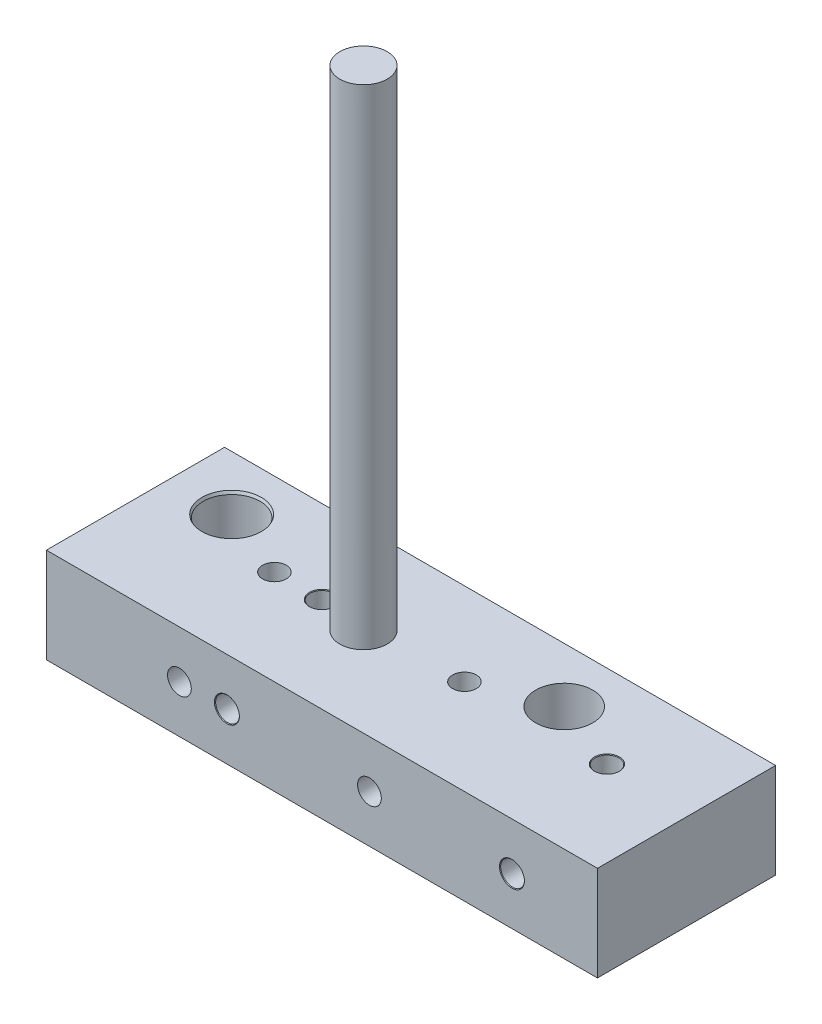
ISO-10303-21;
HEADER;
FILE_DESCRIPTION(('STEP AP214'),'2;1');
FILE_NAME('part.step','',(''),(''),'','','');
FILE_SCHEMA(('AUTOMOTIVE_DESIGN { 1 0 10303 214 1 1 1 1 }'));
ENDSEC;
DATA;
#1=APPLICATION_CONTEXT('core data for automotive mechanical design processes');
#2=APPLICATION_PROTOCOL_DEFINITION('international standard','automotive_design',2000,#1);
#3=PRODUCT_CONTEXT('',#1,'mechanical');
#4=PRODUCT('Part','Part','',(#3));
#5=PRODUCT_RELATED_PRODUCT_CATEGORY('part','',(#4));
#6=PRODUCT_DEFINITION_FORMATION('','',#4);
#7=PRODUCT_DEFINITION_CONTEXT('part definition',#1,'design');
#8=PRODUCT_DEFINITION('design','',#6,#7);
#9=PRODUCT_DEFINITION_SHAPE('','',#8);
#10=(LENGTH_UNIT() NAMED_UNIT(*) SI_UNIT(.MILLI.,.METRE.));
#11=(NAMED_UNIT(*) PLANE_ANGLE_UNIT() SI_UNIT($,.RADIAN.));
#12=(NAMED_UNIT(*) SI_UNIT($,.STERADIAN.) SOLID_ANGLE_UNIT());
#13=UNCERTAINTY_MEASURE_WITH_UNIT(LENGTH_MEASURE(1.E-05),#10,'distance_accuracy_value','');
#14=(GEOMETRIC_REPRESENTATION_CONTEXT(3) GLOBAL_UNCERTAINTY_ASSIGNED_CONTEXT((#13)) GLOBAL_UNIT_ASSIGNED_CONTEXT((#10,
#11,#12)) REPRESENTATION_CONTEXT('',''));
#15=CARTESIAN_POINT('',(0.,0.,0.));
#16=DIRECTION('',(0.,0.,1.));
#17=DIRECTION('',(1.,0.,0.));
#18=AXIS2_PLACEMENT_3D('',#15,#16,#17);
#19=CARTESIAN_POINT('',(0.,20.,-37.5));
#20=DIRECTION('',(0.,-1.,0.));
#21=DIRECTION('',(0.,0.,-1.));
#22=AXIS2_PLACEMENT_3D('',#19,#20,#21);
#23=PLANE('',#22);
#24=CARTESIAN_POINT('',(83.,20.,-26.));
#25=DIRECTION('',(0.,-1.,0.));
#26=DIRECTION('',(0.,0.,-1.));
#27=AXIS2_PLACEMENT_3D('',#24,#25,#26);
#28=CIRCLE('',#27,5.99999999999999);
#29=CARTESIAN_POINT('',(83.,20.,-32.));
#30=VERTEX_POINT('',#29);
#31=EDGE_CURVE('E9178',#30,#30,#28,.T.);
#32=ORIENTED_EDGE('',*,*,#31,.T.);
#33=EDGE_LOOP('',(#32));
#34=FACE_BOUND('',#33,.T.);
#35=DIRECTION('',(0.,0.,1.));
#36=VECTOR('',#35,1.);
#37=CARTESIAN_POINT('',(0.,20.,0.));
#38=LINE('',#37,#36);
#39=CARTESIAN_POINT('',(0.,20.,-37.5));
#40=VERTEX_POINT('',#39);
#41=CARTESIAN_POINT('',(0.,20.,0.));
#42=VERTEX_POINT('',#41);
#43=EDGE_CURVE('E9306',#40,#42,#38,.T.);
#44=ORIENTED_EDGE('',*,*,#43,.T.);
#45=DIRECTION('',(1.,0.,0.));
#46=VECTOR('',#45,1.);
#47=CARTESIAN_POINT('',(0.,20.,0.));
#48=LINE('',#47,#46);
#49=CARTESIAN_POINT('',(116.,20.,0.));
#50=VERTEX_POINT('',#49);
#51=EDGE_CURVE('E9304',#42,#50,#48,.T.);
#52=ORIENTED_EDGE('',*,*,#51,.T.);
#53=DIRECTION('',(0.,0.,-1.));
#54=VECTOR('',#53,1.);
#55=CARTESIAN_POINT('',(116.,20.,0.));
#56=LINE('',#55,#54);
#57=CARTESIAN_POINT('',(116.,20.,-37.5));
#58=VERTEX_POINT('',#57);
#59=EDGE_CURVE('E9302',#50,#58,#56,.T.);
#60=ORIENTED_EDGE('',*,*,#59,.T.);
#61=DIRECTION('',(-1.,0.,0.));
#62=VECTOR('',#61,1.);
#63=CARTESIAN_POINT('',(0.,20.,-37.5));
#64=LINE('',#63,#62);
#65=EDGE_CURVE('E9300',#58,#40,#64,.T.);
#66=ORIENTED_EDGE('',*,*,#65,.T.);
#67=EDGE_LOOP('',(#44,#52,#60,#66));
#68=FACE_BOUND('',#67,.T.);
#69=CARTESIAN_POINT('',(13.,20.,-26.));
#70=DIRECTION('',(0.,-1.,0.));
#71=DIRECTION('',(0.,0.,-1.));
#72=AXIS2_PLACEMENT_3D('',#69,#70,#71);
#73=CIRCLE('',#72,6.25);
#74=CARTESIAN_POINT('',(13.,20.,-32.25));
#75=VERTEX_POINT('',#74);
#76=EDGE_CURVE('E9327',#75,#75,#73,.T.);
#77=ORIENTED_EDGE('',*,*,#76,.T.);
#78=EDGE_LOOP('',(#77));
#79=FACE_BOUND('',#78,.T.);
#80=CARTESIAN_POINT('',(28.,20.,-20.));
#81=DIRECTION('',(0.,-1.,0.));
#82=DIRECTION('',(0.,0.,-1.));
#83=AXIS2_PLACEMENT_3D('',#80,#81,#82);
#84=CIRCLE('',#83,2.5);
#85=CARTESIAN_POINT('',(28.,20.,-22.5));
#86=VERTEX_POINT('',#85);
#87=EDGE_CURVE('E9333',#86,#86,#84,.T.);
#88=ORIENTED_EDGE('',*,*,#87,.T.);
#89=EDGE_LOOP('',(#88));
#90=FACE_BOUND('',#89,.T.);
#91=CARTESIAN_POINT('',(68.,20.,-20.));
#92=DIRECTION('',(0.,-1.,0.));
#93=DIRECTION('',(0.,0.,-1.));
#94=AXIS2_PLACEMENT_3D('',#91,#92,#93);
#95=CIRCLE('',#94,2.5);
#96=CARTESIAN_POINT('',(68.,20.,-22.5));
#97=VERTEX_POINT('',#96);
#98=EDGE_CURVE('E9339',#97,#97,#95,.T.);
#99=ORIENTED_EDGE('',*,*,#98,.T.);
#100=EDGE_LOOP('',(#99));
#101=FACE_BOUND('',#100,.T.);
#102=CARTESIAN_POINT('',(38.,20.,-20.));
#103=DIRECTION('',(0.,-1.,0.));
#104=DIRECTION('',(0.,0.,-1.));
#105=AXIS2_PLACEMENT_3D('',#102,#103,#104);
#106=CIRCLE('',#105,2.625);
#107=CARTESIAN_POINT('',(38.,20.,-22.625));
#108=VERTEX_POINT('',#107);
#109=EDGE_CURVE('E9351',#108,#108,#106,.T.);
#110=ORIENTED_EDGE('',*,*,#109,.T.);
#111=EDGE_LOOP('',(#110));
#112=FACE_BOUND('',#111,.T.);
#113=CARTESIAN_POINT('',(98.,20.,-20.));
#114=DIRECTION('',(0.,-1.,0.));
#115=DIRECTION('',(0.,0.,-1.));
#116=AXIS2_PLACEMENT_3D('',#113,#114,#115);
#117=CIRCLE('',#116,2.62499999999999);
#118=CARTESIAN_POINT('',(98.,20.,-22.625));
#119=VERTEX_POINT('',#118);
#120=EDGE_CURVE('E9363',#119,#119,#117,.T.);
#121=ORIENTED_EDGE('',*,*,#120,.T.);
#122=EDGE_LOOP('',(#121));
#123=FACE_BOUND('',#122,.T.);
#124=CARTESIAN_POINT('',(48.,20.,-18.75));
#125=DIRECTION('',(0.,-1.,0.));
#126=DIRECTION('',(0.,0.,-1.));
#127=AXIS2_PLACEMENT_3D('',#124,#125,#126);
#128=CIRCLE('',#127,5.);
#129=CARTESIAN_POINT('',(48.,20.,-23.75));
#130=VERTEX_POINT('',#129);
#131=EDGE_CURVE('E11',#130,#130,#128,.F.);
#132=ORIENTED_EDGE('',*,*,#131,.F.);
#133=EDGE_LOOP('',(#132));
#134=FACE_BOUND('',#133,.T.);
#135=ADVANCED_FACE('F9174',(#34,#68,#79,#90,#101,#112,#123,#134),#23,.F.);
#136=CARTESIAN_POINT('',(68.,0.,-20.));
#137=DIRECTION('',(0.,-1.,0.));
#138=DIRECTION('',(0.,0.,-1.));
#139=AXIS2_PLACEMENT_3D('',#136,#137,#138);
#140=CYLINDRICAL_SURFACE('',#139,2.5);
#141=CARTESIAN_POINT('',(68.,0.,-20.));
#142=DIRECTION('',(0.,-1.,0.));
#143=DIRECTION('',(0.,0.,-1.));
#144=AXIS2_PLACEMENT_3D('',#141,#142,#143);
#145=CIRCLE('',#144,2.49999999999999);
#146=CARTESIAN_POINT('',(68.,0.,-22.5));
#147=VERTEX_POINT('',#146);
#148=EDGE_CURVE('E9336',#147,#147,#145,.T.);
#149=ORIENTED_EDGE('',*,*,#148,.T.);
#150=EDGE_LOOP('',(#149));
#151=FACE_BOUND('',#150,.T.);
#152=CARTESIAN_POINT('',(68.,10.,-20.));
#153=DIRECTION('',(0.,-0.707106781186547,-0.707106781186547));
#154=DIRECTION('',(0.,-0.707106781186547,0.707106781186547));
#155=AXIS2_PLACEMENT_3D('',#152,#153,#154);
#156=ELLIPSE('',#155,3.53553390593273,2.49999999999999);
#157=CARTESIAN_POINT('',(65.5,10.,-20.));
#158=VERTEX_POINT('',#157);
#159=CARTESIAN_POINT('',(70.5,10.,-20.));
#160=VERTEX_POINT('',#159);
#161=EDGE_CURVE('E9189',#158,#160,#156,.F.);
#162=ORIENTED_EDGE('',*,*,#161,.T.);
#163=CARTESIAN_POINT('',(68.,10.,-20.));
#164=DIRECTION('',(0.,-0.707106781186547,0.707106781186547));
#165=DIRECTION('',(0.,-0.707106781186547,-0.707106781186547));
#166=AXIS2_PLACEMENT_3D('',#163,#164,#165);
#167=ELLIPSE('',#166,3.53553390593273,2.49999999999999);
#168=EDGE_CURVE('E9183',#160,#158,#167,.F.);
#169=ORIENTED_EDGE('',*,*,#168,.T.);
#170=EDGE_LOOP('',(#162,#169));
#171=FACE_BOUND('',#170,.T.);
#172=ADVANCED_FACE('F9252',(#151,#171),#140,.F.);
#173=CARTESIAN_POINT('',(28.,0.,-20.));
#174=DIRECTION('',(0.,-1.,0.));
#175=DIRECTION('',(0.,0.,-1.));
#176=AXIS2_PLACEMENT_3D('',#173,#174,#175);
#177=CYLINDRICAL_SURFACE('',#176,2.49999999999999);
#178=CARTESIAN_POINT('',(28.,0.,-20.));
#179=DIRECTION('',(0.,-1.,0.));
#180=DIRECTION('',(0.,0.,-1.));
#181=AXIS2_PLACEMENT_3D('',#178,#179,#180);
#182=CIRCLE('',#181,2.49999999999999);
#183=CARTESIAN_POINT('',(28.,0.,-22.5));
#184=VERTEX_POINT('',#183);
#185=EDGE_CURVE('E9330',#184,#184,#182,.T.);
#186=ORIENTED_EDGE('',*,*,#185,.T.);
#187=EDGE_LOOP('',(#186));
#188=FACE_BOUND('',#187,.T.);
#189=CARTESIAN_POINT('',(28.,10.,-20.));
#190=DIRECTION('',(0.,-0.707106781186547,-0.707106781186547));
#191=DIRECTION('',(0.,-0.707106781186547,0.707106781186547));
#192=AXIS2_PLACEMENT_3D('',#189,#190,#191);
#193=ELLIPSE('',#192,3.53553390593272,2.49999999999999);
#194=CARTESIAN_POINT('',(25.5,10.,-20.));
#195=VERTEX_POINT('',#194);
#196=CARTESIAN_POINT('',(30.5,10.,-20.));
#197=VERTEX_POINT('',#196);
#198=EDGE_CURVE('E9196',#195,#197,#193,.F.);
#199=ORIENTED_EDGE('',*,*,#198,.T.);
#200=CARTESIAN_POINT('',(28.,10.,-20.));
#201=DIRECTION('',(0.,-0.707106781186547,0.707106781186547));
#202=DIRECTION('',(0.,-0.707106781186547,-0.707106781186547));
#203=AXIS2_PLACEMENT_3D('',#200,#201,#202);
#204=ELLIPSE('',#203,3.53553390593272,2.49999999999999);
#205=EDGE_CURVE('E9250',#197,#195,#204,.F.);
#206=ORIENTED_EDGE('',*,*,#205,.T.);
#207=EDGE_LOOP('',(#199,#206));
#208=FACE_BOUND('',#207,.T.);
#209=ADVANCED_FACE('F9549',(#188,#208),#177,.F.);
#210=CARTESIAN_POINT('',(98.,0.,-20.));
#211=DIRECTION('',(0.,-1.,0.));
#212=DIRECTION('',(0.,0.,-1.));
#213=AXIS2_PLACEMENT_3D('',#210,#211,#212);
#214=CYLINDRICAL_SURFACE('',#213,2.5);
#215=CARTESIAN_POINT('',(98.,0.125000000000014,-20.));
#216=DIRECTION('',(0.,-1.,0.));
#217=DIRECTION('',(0.,0.,-1.));
#218=AXIS2_PLACEMENT_3D('',#215,#216,#217);
#219=CIRCLE('',#218,2.49999999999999);
#220=CARTESIAN_POINT('',(98.,0.125000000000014,-22.5));
#221=VERTEX_POINT('',#220);
#222=EDGE_CURVE('E9357',#221,#221,#219,.T.);
#223=ORIENTED_EDGE('',*,*,#222,.T.);
#224=EDGE_LOOP('',(#223));
#225=FACE_BOUND('',#224,.T.);
#226=CARTESIAN_POINT('',(98.,10.,-20.));
#227=DIRECTION('',(0.,-0.707106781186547,-0.707106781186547));
#228=DIRECTION('',(0.,-0.707106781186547,0.707106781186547));
#229=AXIS2_PLACEMENT_3D('',#226,#227,#228);
#230=ELLIPSE('',#229,3.53553390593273,2.5);
#231=CARTESIAN_POINT('',(95.5,10.,-20.));
#232=VERTEX_POINT('',#231);
#233=CARTESIAN_POINT('',(100.5,10.,-20.));
#234=VERTEX_POINT('',#233);
#235=EDGE_CURVE('E9275',#232,#234,#230,.F.);
#236=ORIENTED_EDGE('',*,*,#235,.T.);
#237=CARTESIAN_POINT('',(98.,10.,-20.));
#238=DIRECTION('',(0.,-0.707106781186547,0.707106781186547));
#239=DIRECTION('',(0.,-0.707106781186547,-0.707106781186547));
#240=AXIS2_PLACEMENT_3D('',#237,#238,#239);
#241=ELLIPSE('',#240,3.53553390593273,2.5);
#242=EDGE_CURVE('E9266',#234,#232,#241,.F.);
#243=ORIENTED_EDGE('',*,*,#242,.T.);
#244=EDGE_LOOP('',(#236,#243));
#245=FACE_BOUND('',#244,.T.);
#246=ADVANCED_FACE('F9525',(#225,#245),#214,.F.);
#247=CARTESIAN_POINT('',(38.,0.,-20.));
#248=DIRECTION('',(0.,-1.,0.));
#249=DIRECTION('',(0.,0.,-1.));
#250=AXIS2_PLACEMENT_3D('',#247,#248,#249);
#251=CYLINDRICAL_SURFACE('',#250,2.5);
#252=CARTESIAN_POINT('',(38.,0.125,-20.));
#253=DIRECTION('',(0.,-1.,0.));
#254=DIRECTION('',(0.,0.,-1.));
#255=AXIS2_PLACEMENT_3D('',#252,#253,#254);
#256=CIRCLE('',#255,2.5);
#257=CARTESIAN_POINT('',(38.,0.125,-22.5));
#258=VERTEX_POINT('',#257);
#259=EDGE_CURVE('E9345',#258,#258,#256,.T.);
#260=ORIENTED_EDGE('',*,*,#259,.T.);
#261=EDGE_LOOP('',(#260));
#262=FACE_BOUND('',#261,.T.);
#263=CARTESIAN_POINT('',(38.,10.,-20.));
#264=DIRECTION('',(0.,-0.707106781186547,-0.707106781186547));
#265=DIRECTION('',(0.,-0.707106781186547,0.707106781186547));
#266=AXIS2_PLACEMENT_3D('',#263,#264,#265);
#267=ELLIPSE('',#266,3.53553390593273,2.49999999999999);
#268=CARTESIAN_POINT('',(35.5,10.,-20.));
#269=VERTEX_POINT('',#268);
#270=CARTESIAN_POINT('',(40.5,10.,-20.));
#271=VERTEX_POINT('',#270);
#272=EDGE_CURVE('E9286',#269,#271,#267,.F.);
#273=ORIENTED_EDGE('',*,*,#272,.T.);
#274=CARTESIAN_POINT('',(38.,10.,-20.));
#275=DIRECTION('',(0.,-0.707106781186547,0.707106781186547));
#276=DIRECTION('',(0.,-0.707106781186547,-0.707106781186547));
#277=AXIS2_PLACEMENT_3D('',#274,#275,#276);
#278=ELLIPSE('',#277,3.53553390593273,2.49999999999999);
#279=EDGE_CURVE('E9277',#271,#269,#278,.F.);
#280=ORIENTED_EDGE('',*,*,#279,.T.);
#281=EDGE_LOOP('',(#273,#280));
#282=FACE_BOUND('',#281,.T.);
#283=ADVANCED_FACE('F9538',(#262,#282),#251,.F.);
#284=CARTESIAN_POINT('',(0.,20.,0.));
#285=DIRECTION('',(1.,0.,0.));
#286=DIRECTION('',(0.,0.,-1.));
#287=AXIS2_PLACEMENT_3D('',#284,#285,#286);
#288=PLANE('',#287);
#289=DIRECTION('',(0.,0.,1.));
#290=VECTOR('',#289,1.);
#291=CARTESIAN_POINT('',(0.,0.,0.));
#292=LINE('',#291,#290);
#293=CARTESIAN_POINT('',(0.,0.,-37.5));
#294=VERTEX_POINT('',#293);
#295=CARTESIAN_POINT('',(0.,0.,0.));
#296=VERTEX_POINT('',#295);
#297=EDGE_CURVE('E9315',#294,#296,#292,.T.);
#298=ORIENTED_EDGE('',*,*,#297,.T.);
#299=DIRECTION('',(0.,-1.,0.));
#300=VECTOR('',#299,1.);
#301=CARTESIAN_POINT('',(0.,20.,0.));
#302=LINE('',#301,#300);
#303=EDGE_CURVE('E9288',#42,#296,#302,.T.);
#304=ORIENTED_EDGE('',*,*,#303,.F.);
#305=ORIENTED_EDGE('',*,*,#43,.F.);
#306=DIRECTION('',(0.,-1.,0.));
#307=VECTOR('',#306,1.);
#308=CARTESIAN_POINT('',(0.,20.,-37.5));
#309=LINE('',#308,#307);
#310=EDGE_CURVE('E9297',#40,#294,#309,.T.);
#311=ORIENTED_EDGE('',*,*,#310,.T.);
#312=EDGE_LOOP('',(#298,#304,#305,#311));
#313=FACE_BOUND('',#312,.T.);
#314=ADVANCED_FACE('F9176',(#313),#288,.F.);
#315=CARTESIAN_POINT('',(0.,20.,0.));
#316=DIRECTION('',(0.,0.,-1.));
#317=DIRECTION('',(-1.,0.,0.));
#318=AXIS2_PLACEMENT_3D('',#315,#316,#317);
#319=PLANE('',#318);
#320=CARTESIAN_POINT('',(68.,10.,0.));
#321=DIRECTION('',(0.,0.,1.));
#322=DIRECTION('',(1.,0.,0.));
#323=AXIS2_PLACEMENT_3D('',#320,#321,#322);
#324=CIRCLE('',#323,2.49999999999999);
#325=CARTESIAN_POINT('',(70.5,10.,0.));
#326=VERTEX_POINT('',#325);
#327=EDGE_CURVE('E9396',#326,#326,#324,.T.);
#328=ORIENTED_EDGE('',*,*,#327,.F.);
#329=EDGE_LOOP('',(#328));
#330=FACE_BOUND('',#329,.T.);
#331=CARTESIAN_POINT('',(28.,10.,0.));
#332=DIRECTION('',(0.,0.,1.));
#333=DIRECTION('',(1.,0.,0.));
#334=AXIS2_PLACEMENT_3D('',#331,#332,#333);
#335=CIRCLE('',#334,2.49999999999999);
#336=CARTESIAN_POINT('',(30.5,10.,0.));
#337=VERTEX_POINT('',#336);
#338=EDGE_CURVE('E9390',#337,#337,#335,.T.);
#339=ORIENTED_EDGE('',*,*,#338,.F.);
#340=EDGE_LOOP('',(#339));
#341=FACE_BOUND('',#340,.T.);
#342=CARTESIAN_POINT('',(98.,10.,0.));
#343=DIRECTION('',(0.,0.,1.));
#344=DIRECTION('',(1.,0.,0.));
#345=AXIS2_PLACEMENT_3D('',#342,#343,#344);
#346=CIRCLE('',#345,2.625);
#347=CARTESIAN_POINT('',(100.625,10.,0.));
#348=VERTEX_POINT('',#347);
#349=EDGE_CURVE('E9378',#348,#348,#346,.T.);
#350=ORIENTED_EDGE('',*,*,#349,.F.);
#351=EDGE_LOOP('',(#350));
#352=FACE_BOUND('',#351,.T.);
#353=CARTESIAN_POINT('',(38.,10.,0.));
#354=DIRECTION('',(0.,0.,1.));
#355=DIRECTION('',(1.,0.,0.));
#356=AXIS2_PLACEMENT_3D('',#353,#354,#355);
#357=CIRCLE('',#356,2.625);
#358=CARTESIAN_POINT('',(40.625,10.,0.));
#359=VERTEX_POINT('',#358);
#360=EDGE_CURVE('E9366',#359,#359,#357,.T.);
#361=ORIENTED_EDGE('',*,*,#360,.F.);
#362=EDGE_LOOP('',(#361));
#363=FACE_BOUND('',#362,.T.);
#364=DIRECTION('',(1.,0.,0.));
#365=VECTOR('',#364,1.);
#366=CARTESIAN_POINT('',(0.,0.,0.));
#367=LINE('',#366,#365);
#368=CARTESIAN_POINT('',(116.,0.,0.));
#369=VERTEX_POINT('',#368);
#370=EDGE_CURVE('E9313',#296,#369,#367,.T.);
#371=ORIENTED_EDGE('',*,*,#370,.T.);
#372=DIRECTION('',(0.,-1.,0.));
#373=VECTOR('',#372,1.);
#374=CARTESIAN_POINT('',(116.,20.,0.));
#375=LINE('',#374,#373);
#376=EDGE_CURVE('E9291',#50,#369,#375,.T.);
#377=ORIENTED_EDGE('',*,*,#376,.F.);
#378=ORIENTED_EDGE('',*,*,#51,.F.);
#379=ORIENTED_EDGE('',*,*,#303,.T.);
#380=EDGE_LOOP('',(#371,#377,#378,#379));
#381=FACE_BOUND('',#380,.T.);
#382=ADVANCED_FACE('F9452',(#330,#341,#352,#363,#381),#319,.F.);
#383=CARTESIAN_POINT('',(116.,20.,0.));
#384=DIRECTION('',(-1.,0.,0.));
#385=DIRECTION('',(0.,0.,1.));
#386=AXIS2_PLACEMENT_3D('',#383,#384,#385);
#387=PLANE('',#386);
#388=DIRECTION('',(0.,0.,-1.));
#389=VECTOR('',#388,1.);
#390=CARTESIAN_POINT('',(116.,0.,0.));
#391=LINE('',#390,#389);
#392=CARTESIAN_POINT('',(116.,0.,-37.5));
#393=VERTEX_POINT('',#392);
#394=EDGE_CURVE('E9311',#369,#393,#391,.T.);
#395=ORIENTED_EDGE('',*,*,#394,.T.);
#396=DIRECTION('',(0.,-1.,0.));
#397=VECTOR('',#396,1.);
#398=CARTESIAN_POINT('',(116.,20.,-37.5));
#399=LINE('',#398,#397);
#400=EDGE_CURVE('E9294',#58,#393,#399,.T.);
#401=ORIENTED_EDGE('',*,*,#400,.F.);
#402=ORIENTED_EDGE('',*,*,#59,.F.);
#403=ORIENTED_EDGE('',*,*,#376,.T.);
#404=EDGE_LOOP('',(#395,#401,#402,#403));
#405=FACE_BOUND('',#404,.T.);
#406=ADVANCED_FACE('F9449',(#405),#387,.F.);
#407=CARTESIAN_POINT('',(0.,20.,-37.5));
#408=DIRECTION('',(0.,0.,1.));
#409=DIRECTION('',(1.,0.,0.));
#410=AXIS2_PLACEMENT_3D('',#407,#408,#409);
#411=PLANE('',#410);
#412=CARTESIAN_POINT('',(68.,10.,-37.5));
#413=DIRECTION('',(0.,0.,1.));
#414=DIRECTION('',(1.,0.,0.));
#415=AXIS2_PLACEMENT_3D('',#412,#413,#414);
#416=CIRCLE('',#415,2.49999999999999);
#417=CARTESIAN_POINT('',(70.5,10.,-37.5));
#418=VERTEX_POINT('',#417);
#419=EDGE_CURVE('E9399',#418,#418,#416,.T.);
#420=ORIENTED_EDGE('',*,*,#419,.T.);
#421=EDGE_LOOP('',(#420));
#422=FACE_BOUND('',#421,.T.);
#423=CARTESIAN_POINT('',(28.,10.,-37.5));
#424=DIRECTION('',(0.,0.,1.));
#425=DIRECTION('',(1.,0.,0.));
#426=AXIS2_PLACEMENT_3D('',#423,#424,#425);
#427=CIRCLE('',#426,2.49999999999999);
#428=CARTESIAN_POINT('',(30.5,10.,-37.5));
#429=VERTEX_POINT('',#428);
#430=EDGE_CURVE('E9393',#429,#429,#427,.T.);
#431=ORIENTED_EDGE('',*,*,#430,.T.);
#432=EDGE_LOOP('',(#431));
#433=FACE_BOUND('',#432,.T.);
#434=CARTESIAN_POINT('',(98.,10.,-37.5));
#435=DIRECTION('',(0.,0.,1.));
#436=DIRECTION('',(1.,0.,0.));
#437=AXIS2_PLACEMENT_3D('',#434,#435,#436);
#438=CIRCLE('',#437,2.62499999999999);
#439=CARTESIAN_POINT('',(100.625,10.,-37.5));
#440=VERTEX_POINT('',#439);
#441=EDGE_CURVE('E9387',#440,#440,#438,.T.);
#442=ORIENTED_EDGE('',*,*,#441,.T.);
#443=EDGE_LOOP('',(#442));
#444=FACE_BOUND('',#443,.T.);
#445=CARTESIAN_POINT('',(38.,10.,-37.5));
#446=DIRECTION('',(0.,0.,1.));
#447=DIRECTION('',(1.,0.,0.));
#448=AXIS2_PLACEMENT_3D('',#445,#446,#447);
#449=CIRCLE('',#448,2.62499999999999);
#450=CARTESIAN_POINT('',(40.625,10.,-37.5));
#451=VERTEX_POINT('',#450);
#452=EDGE_CURVE('E9375',#451,#451,#449,.T.);
#453=ORIENTED_EDGE('',*,*,#452,.T.);
#454=EDGE_LOOP('',(#453));
#455=FACE_BOUND('',#454,.T.);
#456=DIRECTION('',(-1.,0.,0.));
#457=VECTOR('',#456,1.);
#458=CARTESIAN_POINT('',(0.,0.,-37.5));
#459=LINE('',#458,#457);
#460=EDGE_CURVE('E9309',#393,#294,#459,.T.);
#461=ORIENTED_EDGE('',*,*,#460,.T.);
#462=ORIENTED_EDGE('',*,*,#310,.F.);
#463=ORIENTED_EDGE('',*,*,#65,.F.);
#464=ORIENTED_EDGE('',*,*,#400,.T.);
#465=EDGE_LOOP('',(#461,#462,#463,#464));
#466=FACE_BOUND('',#465,.T.);
#467=ADVANCED_FACE('F9425',(#422,#433,#444,#455,#466),#411,.F.);
#468=CARTESIAN_POINT('',(0.,0.,-37.5));
#469=DIRECTION('',(0.,-1.,0.));
#470=DIRECTION('',(0.,0.,-1.));
#471=AXIS2_PLACEMENT_3D('',#468,#469,#470);
#472=PLANE('',#471);
#473=CARTESIAN_POINT('',(83.,0.,-26.));
#474=DIRECTION('',(0.,-1.,0.));
#475=DIRECTION('',(0.,0.,-1.));
#476=AXIS2_PLACEMENT_3D('',#473,#474,#475);
#477=CIRCLE('',#476,6.25000000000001);
#478=CARTESIAN_POINT('',(83.,0.,-32.25));
#479=VERTEX_POINT('',#478);
#480=EDGE_CURVE('E9405',#479,#479,#477,.T.);
#481=ORIENTED_EDGE('',*,*,#480,.F.);
#482=EDGE_LOOP('',(#481));
#483=FACE_BOUND('',#482,.T.);
#484=CARTESIAN_POINT('',(98.,0.,-20.));
#485=DIRECTION('',(0.,-1.,0.));
#486=DIRECTION('',(0.,0.,-1.));
#487=AXIS2_PLACEMENT_3D('',#484,#485,#486);
#488=CIRCLE('',#487,2.625);
#489=CARTESIAN_POINT('',(98.,0.,-22.625));
#490=VERTEX_POINT('',#489);
#491=EDGE_CURVE('E9354',#490,#490,#488,.T.);
#492=ORIENTED_EDGE('',*,*,#491,.F.);
#493=EDGE_LOOP('',(#492));
#494=FACE_BOUND('',#493,.T.);
#495=CARTESIAN_POINT('',(38.,0.,-20.));
#496=DIRECTION('',(0.,-1.,0.));
#497=DIRECTION('',(0.,0.,-1.));
#498=AXIS2_PLACEMENT_3D('',#495,#496,#497);
#499=CIRCLE('',#498,2.625);
#500=CARTESIAN_POINT('',(38.,0.,-22.625));
#501=VERTEX_POINT('',#500);
#502=EDGE_CURVE('E9342',#501,#501,#499,.T.);
#503=ORIENTED_EDGE('',*,*,#502,.F.);
#504=EDGE_LOOP('',(#503));
#505=FACE_BOUND('',#504,.T.);
#506=ORIENTED_EDGE('',*,*,#148,.F.);
#507=EDGE_LOOP('',(#506));
#508=FACE_BOUND('',#507,.T.);
#509=ORIENTED_EDGE('',*,*,#185,.F.);
#510=EDGE_LOOP('',(#509));
#511=FACE_BOUND('',#510,.T.);
#512=CARTESIAN_POINT('',(13.,0.,-26.));
#513=DIRECTION('',(0.,-1.,0.));
#514=DIRECTION('',(0.,0.,-1.));
#515=AXIS2_PLACEMENT_3D('',#512,#513,#514);
#516=CIRCLE('',#515,6.25);
#517=CARTESIAN_POINT('',(13.,0.,-32.25));
#518=VERTEX_POINT('',#517);
#519=EDGE_CURVE('E9318',#518,#518,#516,.T.);
#520=ORIENTED_EDGE('',*,*,#519,.F.);
#521=EDGE_LOOP('',(#520));
#522=FACE_BOUND('',#521,.T.);
#523=ORIENTED_EDGE('',*,*,#297,.F.);
#524=ORIENTED_EDGE('',*,*,#460,.F.);
#525=ORIENTED_EDGE('',*,*,#394,.F.);
#526=ORIENTED_EDGE('',*,*,#370,.F.);
#527=EDGE_LOOP('',(#523,#524,#525,#526));
#528=FACE_BOUND('',#527,.T.);
#529=ADVANCED_FACE('F9421',(#483,#494,#505,#508,#511,#522,#528),#472,.T.);
#530=CARTESIAN_POINT('',(13.,0.,-26.));
#531=DIRECTION('',(0.,-1.,0.));
#532=DIRECTION('',(0.,0.,-1.));
#533=AXIS2_PLACEMENT_3D('',#530,#531,#532);
#534=CONICAL_SURFACE('',#533,6.25,0.392699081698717);
#535=CARTESIAN_POINT('',(13.,0.603553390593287,-26.));
#536=DIRECTION('',(0.,-1.,0.));
#537=DIRECTION('',(0.,0.,-1.));
#538=AXIS2_PLACEMENT_3D('',#535,#536,#537);
#539=CIRCLE('',#538,6.);
#540=CARTESIAN_POINT('',(13.,0.603553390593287,-32.));
#541=VERTEX_POINT('',#540);
#542=EDGE_CURVE('E9321',#541,#541,#539,.T.);
#543=ORIENTED_EDGE('',*,*,#542,.F.);
#544=EDGE_LOOP('',(#543));
#545=FACE_BOUND('',#544,.T.);
#546=ORIENTED_EDGE('',*,*,#519,.T.);
#547=EDGE_LOOP('',(#546));
#548=FACE_BOUND('',#547,.T.);
#549=ADVANCED_FACE('F9424',(#545,#548),#534,.F.);
#550=CARTESIAN_POINT('',(13.,0.,-26.));
#551=DIRECTION('',(0.,-1.,0.));
#552=DIRECTION('',(0.,0.,-1.));
#553=AXIS2_PLACEMENT_3D('',#550,#551,#552);
#554=CYLINDRICAL_SURFACE('',#553,6.);
#555=CARTESIAN_POINT('',(13.,19.3964466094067,-26.));
#556=DIRECTION('',(0.,-1.,0.));
#557=DIRECTION('',(0.,0.,-1.));
#558=AXIS2_PLACEMENT_3D('',#555,#556,#557);
#559=CIRCLE('',#558,5.99999999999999);
#560=CARTESIAN_POINT('',(13.,19.3964466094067,-32.));
#561=VERTEX_POINT('',#560);
#562=EDGE_CURVE('E9324',#561,#561,#559,.T.);
#563=ORIENTED_EDGE('',*,*,#562,.F.);
#564=EDGE_LOOP('',(#563));
#565=FACE_BOUND('',#564,.T.);
#566=ORIENTED_EDGE('',*,*,#542,.T.);
#567=EDGE_LOOP('',(#566));
#568=FACE_BOUND('',#567,.T.);
#569=ADVANCED_FACE('F9552',(#565,#568),#554,.F.);
#570=CARTESIAN_POINT('',(13.,19.3964466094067,-26.));
#571=DIRECTION('',(0.,1.,0.));
#572=DIRECTION('',(0.,0.,1.));
#573=AXIS2_PLACEMENT_3D('',#570,#571,#572);
#574=CONICAL_SURFACE('',#573,5.99999999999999,0.392699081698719);
#575=ORIENTED_EDGE('',*,*,#76,.F.);
#576=EDGE_LOOP('',(#575));
#577=FACE_BOUND('',#576,.T.);
#578=ORIENTED_EDGE('',*,*,#562,.T.);
#579=EDGE_LOOP('',(#578));
#580=FACE_BOUND('',#579,.T.);
#581=ADVANCED_FACE('F9547',(#577,#580),#574,.F.);
#582=CARTESIAN_POINT('',(28.,10.,-20.));
#583=DIRECTION('',(0.,-0.707106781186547,-0.707106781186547));
#584=DIRECTION('',(0.,-0.707106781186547,0.707106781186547));
#585=AXIS2_PLACEMENT_3D('',#582,#583,#584);
#586=ELLIPSE('',#585,3.53553390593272,2.49999999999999);
#587=EDGE_CURVE('E9262',#195,#197,#586,.T.);
#588=ORIENTED_EDGE('',*,*,#587,.T.);
#589=CARTESIAN_POINT('',(28.,10.,-20.));
#590=DIRECTION('',(0.,-0.707106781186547,0.707106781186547));
#591=DIRECTION('',(0.,-0.707106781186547,-0.707106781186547));
#592=AXIS2_PLACEMENT_3D('',#589,#590,#591);
#593=ELLIPSE('',#592,3.53553390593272,2.49999999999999);
#594=EDGE_CURVE('E9259',#197,#195,#593,.T.);
#595=ORIENTED_EDGE('',*,*,#594,.T.);
#596=EDGE_LOOP('',(#588,#595));
#597=FACE_BOUND('',#596,.T.);
#598=ORIENTED_EDGE('',*,*,#87,.F.);
#599=EDGE_LOOP('',(#598));
#600=FACE_BOUND('',#599,.T.);
#601=ADVANCED_FACE('F9544',(#597,#600),#177,.F.);
#602=CARTESIAN_POINT('',(68.,10.,-20.));
#603=DIRECTION('',(0.,-0.707106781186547,-0.707106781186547));
#604=DIRECTION('',(0.,-0.707106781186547,0.707106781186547));
#605=AXIS2_PLACEMENT_3D('',#602,#603,#604);
#606=ELLIPSE('',#605,3.53553390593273,2.49999999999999);
#607=EDGE_CURVE('E9242',#158,#160,#606,.T.);
#608=ORIENTED_EDGE('',*,*,#607,.T.);
#609=CARTESIAN_POINT('',(68.,10.,-20.));
#610=DIRECTION('',(0.,-0.707106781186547,0.707106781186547));
#611=DIRECTION('',(0.,-0.707106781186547,-0.707106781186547));
#612=AXIS2_PLACEMENT_3D('',#609,#610,#611);
#613=ELLIPSE('',#612,3.53553390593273,2.49999999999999);
#614=EDGE_CURVE('E9246',#160,#158,#613,.T.);
#615=ORIENTED_EDGE('',*,*,#614,.T.);
#616=EDGE_LOOP('',(#608,#615));
#617=FACE_BOUND('',#616,.T.);
#618=ORIENTED_EDGE('',*,*,#98,.F.);
#619=EDGE_LOOP('',(#618));
#620=FACE_BOUND('',#619,.T.);
#621=ADVANCED_FACE('F9254',(#617,#620),#140,.F.);
#622=CARTESIAN_POINT('',(38.,0.,-20.));
#623=DIRECTION('',(0.,-1.,0.));
#624=DIRECTION('',(0.,0.,-1.));
#625=AXIS2_PLACEMENT_3D('',#622,#623,#624);
#626=CONICAL_SURFACE('',#625,2.625,0.785398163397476);
#627=ORIENTED_EDGE('',*,*,#259,.F.);
#628=EDGE_LOOP('',(#627));
#629=FACE_BOUND('',#628,.T.);
#630=ORIENTED_EDGE('',*,*,#502,.T.);
#631=EDGE_LOOP('',(#630));
#632=FACE_BOUND('',#631,.T.);
#633=ADVANCED_FACE('F9536',(#629,#632),#626,.F.);
#634=CARTESIAN_POINT('',(38.,10.,-20.));
#635=DIRECTION('',(0.,-0.707106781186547,-0.707106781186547));
#636=DIRECTION('',(0.,-0.707106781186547,0.707106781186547));
#637=AXIS2_PLACEMENT_3D('',#634,#635,#636);
#638=ELLIPSE('',#637,3.53553390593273,2.49999999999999);
#639=EDGE_CURVE('E9283',#269,#271,#638,.T.);
#640=ORIENTED_EDGE('',*,*,#639,.T.);
#641=CARTESIAN_POINT('',(38.,10.,-20.));
#642=DIRECTION('',(0.,-0.707106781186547,0.707106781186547));
#643=DIRECTION('',(0.,-0.707106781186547,-0.707106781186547));
#644=AXIS2_PLACEMENT_3D('',#641,#642,#643);
#645=ELLIPSE('',#644,3.53553390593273,2.49999999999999);
#646=EDGE_CURVE('E9280',#271,#269,#645,.T.);
#647=ORIENTED_EDGE('',*,*,#646,.T.);
#648=EDGE_LOOP('',(#640,#647));
#649=FACE_BOUND('',#648,.T.);
#650=CARTESIAN_POINT('',(38.,19.875,-20.));
#651=DIRECTION('',(0.,-1.,0.));
#652=DIRECTION('',(0.,0.,-1.));
#653=AXIS2_PLACEMENT_3D('',#650,#651,#652);
#654=CIRCLE('',#653,2.5);
#655=CARTESIAN_POINT('',(38.,19.875,-22.5));
#656=VERTEX_POINT('',#655);
#657=EDGE_CURVE('E9348',#656,#656,#654,.T.);
#658=ORIENTED_EDGE('',*,*,#657,.F.);
#659=EDGE_LOOP('',(#658));
#660=FACE_BOUND('',#659,.T.);
#661=ADVANCED_FACE('F9532',(#649,#660),#251,.F.);
#662=CARTESIAN_POINT('',(38.,19.875,-20.));
#663=DIRECTION('',(0.,1.,0.));
#664=DIRECTION('',(0.,0.,1.));
#665=AXIS2_PLACEMENT_3D('',#662,#663,#664);
#666=CONICAL_SURFACE('',#665,2.5,0.785398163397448);
#667=ORIENTED_EDGE('',*,*,#109,.F.);
#668=EDGE_LOOP('',(#667));
#669=FACE_BOUND('',#668,.T.);
#670=ORIENTED_EDGE('',*,*,#657,.T.);
#671=EDGE_LOOP('',(#670));
#672=FACE_BOUND('',#671,.T.);
#673=ADVANCED_FACE('F9528',(#669,#672),#666,.F.);
#674=CARTESIAN_POINT('',(98.,0.,-20.));
#675=DIRECTION('',(0.,-1.,0.));
#676=DIRECTION('',(0.,0.,-1.));
#677=AXIS2_PLACEMENT_3D('',#674,#675,#676);
#678=CONICAL_SURFACE('',#677,2.625,0.785398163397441);
#679=ORIENTED_EDGE('',*,*,#222,.F.);
#680=EDGE_LOOP('',(#679));
#681=FACE_BOUND('',#680,.T.);
#682=ORIENTED_EDGE('',*,*,#491,.T.);
#683=EDGE_LOOP('',(#682));
#684=FACE_BOUND('',#683,.T.);
#685=ADVANCED_FACE('F9523',(#681,#684),#678,.F.);
#686=CARTESIAN_POINT('',(98.,10.,-20.));
#687=DIRECTION('',(0.,-0.707106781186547,-0.707106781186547));
#688=DIRECTION('',(0.,-0.707106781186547,0.707106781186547));
#689=AXIS2_PLACEMENT_3D('',#686,#687,#688);
#690=ELLIPSE('',#689,3.53553390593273,2.5);
#691=EDGE_CURVE('E9272',#232,#234,#690,.T.);
#692=ORIENTED_EDGE('',*,*,#691,.T.);
#693=CARTESIAN_POINT('',(98.,10.,-20.));
#694=DIRECTION('',(0.,-0.707106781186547,0.707106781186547));
#695=DIRECTION('',(0.,-0.707106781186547,-0.707106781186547));
#696=AXIS2_PLACEMENT_3D('',#693,#694,#695);
#697=ELLIPSE('',#696,3.53553390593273,2.5);
#698=EDGE_CURVE('E9269',#234,#232,#697,.T.);
#699=ORIENTED_EDGE('',*,*,#698,.T.);
#700=EDGE_LOOP('',(#692,#699));
#701=FACE_BOUND('',#700,.T.);
#702=CARTESIAN_POINT('',(98.,19.875,-20.));
#703=DIRECTION('',(0.,-1.,0.));
#704=DIRECTION('',(0.,0.,-1.));
#705=AXIS2_PLACEMENT_3D('',#702,#703,#704);
#706=CIRCLE('',#705,2.5);
#707=CARTESIAN_POINT('',(98.,19.875,-22.5));
#708=VERTEX_POINT('',#707);
#709=EDGE_CURVE('E9360',#708,#708,#706,.T.);
#710=ORIENTED_EDGE('',*,*,#709,.F.);
#711=EDGE_LOOP('',(#710));
#712=FACE_BOUND('',#711,.T.);
#713=ADVANCED_FACE('F9519',(#701,#712),#214,.F.);
#714=CARTESIAN_POINT('',(98.,19.875,-20.));
#715=DIRECTION('',(0.,1.,0.));
#716=DIRECTION('',(0.,0.,1.));
#717=AXIS2_PLACEMENT_3D('',#714,#715,#716);
#718=CONICAL_SURFACE('',#717,2.5,0.785398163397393);
#719=ORIENTED_EDGE('',*,*,#120,.F.);
#720=EDGE_LOOP('',(#719));
#721=FACE_BOUND('',#720,.T.);
#722=ORIENTED_EDGE('',*,*,#709,.T.);
#723=EDGE_LOOP('',(#722));
#724=FACE_BOUND('',#723,.T.);
#725=ADVANCED_FACE('F9516',(#721,#724),#718,.F.);
#726=CARTESIAN_POINT('',(38.,10.,0.));
#727=DIRECTION('',(0.,0.,1.));
#728=DIRECTION('',(1.,0.,0.));
#729=AXIS2_PLACEMENT_3D('',#726,#727,#728);
#730=CYLINDRICAL_SURFACE('',#729,2.49999999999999);
#731=CARTESIAN_POINT('',(38.,10.,-0.125000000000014));
#732=DIRECTION('',(0.,0.,1.));
#733=DIRECTION('',(1.,0.,0.));
#734=AXIS2_PLACEMENT_3D('',#731,#732,#733);
#735=CIRCLE('',#734,2.49999999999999);
#736=CARTESIAN_POINT('',(40.5,10.,-0.125000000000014));
#737=VERTEX_POINT('',#736);
#738=EDGE_CURVE('E9369',#737,#737,#735,.T.);
#739=ORIENTED_EDGE('',*,*,#738,.T.);
#740=EDGE_LOOP('',(#739));
#741=FACE_BOUND('',#740,.T.);
#742=ORIENTED_EDGE('',*,*,#272,.F.);
#743=ORIENTED_EDGE('',*,*,#646,.F.);
#744=EDGE_LOOP('',(#742,#743));
#745=FACE_BOUND('',#744,.T.);
#746=ADVANCED_FACE('F9512',(#741,#745),#730,.F.);
#747=CARTESIAN_POINT('',(38.,10.,0.));
#748=DIRECTION('',(0.,0.,1.));
#749=DIRECTION('',(1.,0.,0.));
#750=AXIS2_PLACEMENT_3D('',#747,#748,#749);
#751=CONICAL_SURFACE('',#750,2.625,0.785398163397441);
#752=ORIENTED_EDGE('',*,*,#738,.F.);
#753=EDGE_LOOP('',(#752));
#754=FACE_BOUND('',#753,.T.);
#755=ORIENTED_EDGE('',*,*,#360,.T.);
#756=EDGE_LOOP('',(#755));
#757=FACE_BOUND('',#756,.T.);
#758=ADVANCED_FACE('F9510',(#754,#757),#751,.F.);
#759=CARTESIAN_POINT('',(38.,10.,-37.375));
#760=DIRECTION('',(0.,0.,1.));
#761=DIRECTION('',(1.,0.,0.));
#762=AXIS2_PLACEMENT_3D('',#759,#760,#761);
#763=CIRCLE('',#762,2.5);
#764=CARTESIAN_POINT('',(40.5,10.,-37.375));
#765=VERTEX_POINT('',#764);
#766=EDGE_CURVE('E9372',#765,#765,#763,.T.);
#767=ORIENTED_EDGE('',*,*,#766,.F.);
#768=EDGE_LOOP('',(#767));
#769=FACE_BOUND('',#768,.T.);
#770=ORIENTED_EDGE('',*,*,#639,.F.);
#771=ORIENTED_EDGE('',*,*,#279,.F.);
#772=EDGE_LOOP('',(#770,#771));
#773=FACE_BOUND('',#772,.T.);
#774=ADVANCED_FACE('F9506',(#769,#773),#730,.F.);
#775=CARTESIAN_POINT('',(38.,10.,-37.375));
#776=DIRECTION('',(0.,0.,-1.));
#777=DIRECTION('',(-1.,0.,0.));
#778=AXIS2_PLACEMENT_3D('',#775,#776,#777);
#779=CONICAL_SURFACE('',#778,2.5,0.785398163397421);
#780=ORIENTED_EDGE('',*,*,#452,.F.);
#781=EDGE_LOOP('',(#780));
#782=FACE_BOUND('',#781,.T.);
#783=ORIENTED_EDGE('',*,*,#766,.T.);
#784=EDGE_LOOP('',(#783));
#785=FACE_BOUND('',#784,.T.);
#786=ADVANCED_FACE('F9503',(#782,#785),#779,.F.);
#787=CARTESIAN_POINT('',(98.,10.,0.));
#788=DIRECTION('',(0.,0.,1.));
#789=DIRECTION('',(1.,0.,0.));
#790=AXIS2_PLACEMENT_3D('',#787,#788,#789);
#791=CYLINDRICAL_SURFACE('',#790,2.5);
#792=CARTESIAN_POINT('',(98.,10.,-0.125000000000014));
#793=DIRECTION('',(0.,0.,1.));
#794=DIRECTION('',(1.,0.,0.));
#795=AXIS2_PLACEMENT_3D('',#792,#793,#794);
#796=CIRCLE('',#795,2.49999999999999);
#797=CARTESIAN_POINT('',(100.5,10.,-0.125000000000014));
#798=VERTEX_POINT('',#797);
#799=EDGE_CURVE('E9381',#798,#798,#796,.T.);
#800=ORIENTED_EDGE('',*,*,#799,.T.);
#801=EDGE_LOOP('',(#800));
#802=FACE_BOUND('',#801,.T.);
#803=ORIENTED_EDGE('',*,*,#235,.F.);
#804=ORIENTED_EDGE('',*,*,#698,.F.);
#805=EDGE_LOOP('',(#803,#804));
#806=FACE_BOUND('',#805,.T.);
#807=ADVANCED_FACE('F9499',(#802,#806),#791,.F.);
#808=CARTESIAN_POINT('',(98.,10.,0.));
#809=DIRECTION('',(0.,0.,1.));
#810=DIRECTION('',(1.,0.,0.));
#811=AXIS2_PLACEMENT_3D('',#808,#809,#810);
#812=CONICAL_SURFACE('',#811,2.625,0.785398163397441);
#813=ORIENTED_EDGE('',*,*,#799,.F.);
#814=EDGE_LOOP('',(#813));
#815=FACE_BOUND('',#814,.T.);
#816=ORIENTED_EDGE('',*,*,#349,.T.);
#817=EDGE_LOOP('',(#816));
#818=FACE_BOUND('',#817,.T.);
#819=ADVANCED_FACE('F9497',(#815,#818),#812,.F.);
#820=CARTESIAN_POINT('',(98.,10.,-37.375));
#821=DIRECTION('',(0.,0.,1.));
#822=DIRECTION('',(1.,0.,0.));
#823=AXIS2_PLACEMENT_3D('',#820,#821,#822);
#824=CIRCLE('',#823,2.5);
#825=CARTESIAN_POINT('',(100.5,10.,-37.375));
#826=VERTEX_POINT('',#825);
#827=EDGE_CURVE('E9384',#826,#826,#824,.T.);
#828=ORIENTED_EDGE('',*,*,#827,.F.);
#829=EDGE_LOOP('',(#828));
#830=FACE_BOUND('',#829,.T.);
#831=ORIENTED_EDGE('',*,*,#691,.F.);
#832=ORIENTED_EDGE('',*,*,#242,.F.);
#833=EDGE_LOOP('',(#831,#832));
#834=FACE_BOUND('',#833,.T.);
#835=ADVANCED_FACE('F9493',(#830,#834),#791,.F.);
#836=CARTESIAN_POINT('',(98.,10.,-37.375));
#837=DIRECTION('',(0.,0.,-1.));
#838=DIRECTION('',(-1.,0.,0.));
#839=AXIS2_PLACEMENT_3D('',#836,#837,#838);
#840=CONICAL_SURFACE('',#839,2.5,0.785398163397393);
#841=ORIENTED_EDGE('',*,*,#441,.F.);
#842=EDGE_LOOP('',(#841));
#843=FACE_BOUND('',#842,.T.);
#844=ORIENTED_EDGE('',*,*,#827,.T.);
#845=EDGE_LOOP('',(#844));
#846=FACE_BOUND('',#845,.T.);
#847=ADVANCED_FACE('F9490',(#843,#846),#840,.F.);
#848=CARTESIAN_POINT('',(28.,10.,0.));
#849=DIRECTION('',(0.,0.,1.));
#850=DIRECTION('',(1.,0.,0.));
#851=AXIS2_PLACEMENT_3D('',#848,#849,#850);
#852=CYLINDRICAL_SURFACE('',#851,2.49999999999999);
#853=ORIENTED_EDGE('',*,*,#338,.T.);
#854=EDGE_LOOP('',(#853));
#855=FACE_BOUND('',#854,.T.);
#856=ORIENTED_EDGE('',*,*,#198,.F.);
#857=ORIENTED_EDGE('',*,*,#594,.F.);
#858=EDGE_LOOP('',(#856,#857));
#859=FACE_BOUND('',#858,.T.);
#860=ADVANCED_FACE('F9488',(#855,#859),#852,.F.);
#861=ORIENTED_EDGE('',*,*,#430,.F.);
#862=EDGE_LOOP('',(#861));
#863=FACE_BOUND('',#862,.T.);
#864=ORIENTED_EDGE('',*,*,#587,.F.);
#865=ORIENTED_EDGE('',*,*,#205,.F.);
#866=EDGE_LOOP('',(#864,#865));
#867=FACE_BOUND('',#866,.T.);
#868=ADVANCED_FACE('F9485',(#863,#867),#852,.F.);
#869=CARTESIAN_POINT('',(68.,10.,0.));
#870=DIRECTION('',(0.,0.,1.));
#871=DIRECTION('',(1.,0.,0.));
#872=AXIS2_PLACEMENT_3D('',#869,#870,#871);
#873=CYLINDRICAL_SURFACE('',#872,2.49999999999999);
#874=ORIENTED_EDGE('',*,*,#327,.T.);
#875=EDGE_LOOP('',(#874));
#876=FACE_BOUND('',#875,.T.);
#877=ORIENTED_EDGE('',*,*,#161,.F.);
#878=ORIENTED_EDGE('',*,*,#614,.F.);
#879=EDGE_LOOP('',(#877,#878));
#880=FACE_BOUND('',#879,.T.);
#881=ADVANCED_FACE('F9249',(#876,#880),#873,.F.);
#882=ORIENTED_EDGE('',*,*,#419,.F.);
#883=EDGE_LOOP('',(#882));
#884=FACE_BOUND('',#883,.T.);
#885=ORIENTED_EDGE('',*,*,#607,.F.);
#886=ORIENTED_EDGE('',*,*,#168,.F.);
#887=EDGE_LOOP('',(#885,#886));
#888=FACE_BOUND('',#887,.T.);
#889=ADVANCED_FACE('F9243',(#884,#888),#873,.F.);
#890=CARTESIAN_POINT('',(48.,123.,-18.75));
#891=DIRECTION('',(0.,-1.,0.));
#892=DIRECTION('',(0.,0.,-1.));
#893=AXIS2_PLACEMENT_3D('',#890,#891,#892);
#894=CYLINDRICAL_SURFACE('',#893,5.);
#895=CARTESIAN_POINT('',(48.,123.,-18.75));
#896=DIRECTION('',(0.,1.,0.));
#897=DIRECTION('',(0.,0.,1.));
#898=AXIS2_PLACEMENT_3D('',#895,#896,#897);
#899=CIRCLE('',#898,5.);
#900=CARTESIAN_POINT('',(48.,123.,-13.75));
#901=VERTEX_POINT('',#900);
#902=EDGE_CURVE('E9402',#901,#901,#899,.T.);
#903=ORIENTED_EDGE('',*,*,#902,.F.);
#904=EDGE_LOOP('',(#903));
#905=FACE_BOUND('',#904,.T.);
#906=ORIENTED_EDGE('',*,*,#131,.T.);
#907=EDGE_LOOP('',(#906));
#908=FACE_BOUND('',#907,.T.);
#909=ADVANCED_FACE('F9470',(#905,#908),#894,.T.);
#910=CARTESIAN_POINT('',(48.,123.,-18.75));
#911=DIRECTION('',(0.,1.,0.));
#912=DIRECTION('',(0.,0.,1.));
#913=AXIS2_PLACEMENT_3D('',#910,#911,#912);
#914=PLANE('',#913);
#915=ORIENTED_EDGE('',*,*,#902,.T.);
#916=EDGE_LOOP('',(#915));
#917=FACE_BOUND('',#916,.T.);
#918=ADVANCED_FACE('F9472',(#917),#914,.T.);
#919=CARTESIAN_POINT('',(83.,0.,-26.));
#920=DIRECTION('',(0.,-1.,0.));
#921=DIRECTION('',(0.,0.,-1.));
#922=AXIS2_PLACEMENT_3D('',#919,#920,#921);
#923=CYLINDRICAL_SURFACE('',#922,5.99999999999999);
#924=CARTESIAN_POINT('',(83.,0.603553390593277,-26.));
#925=DIRECTION('',(0.,-1.,0.));
#926=DIRECTION('',(0.,0.,-1.));
#927=AXIS2_PLACEMENT_3D('',#924,#925,#926);
#928=CIRCLE('',#927,6.00000000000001);
#929=CARTESIAN_POINT('',(83.,0.603553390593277,-32.));
#930=VERTEX_POINT('',#929);
#931=EDGE_CURVE('E9408',#930,#930,#928,.T.);
#932=ORIENTED_EDGE('',*,*,#931,.T.);
#933=EDGE_LOOP('',(#932));
#934=FACE_BOUND('',#933,.T.);
#935=ORIENTED_EDGE('',*,*,#31,.F.);
#936=EDGE_LOOP('',(#935));
#937=FACE_BOUND('',#936,.T.);
#938=ADVANCED_FACE('F9412',(#934,#937),#923,.F.);
#939=CARTESIAN_POINT('',(83.,0.,-26.));
#940=DIRECTION('',(0.,-1.,0.));
#941=DIRECTION('',(0.,0.,-1.));
#942=AXIS2_PLACEMENT_3D('',#939,#940,#941);
#943=CONICAL_SURFACE('',#942,6.25000000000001,0.392699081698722);
#944=ORIENTED_EDGE('',*,*,#931,.F.);
#945=EDGE_LOOP('',(#944));
#946=FACE_BOUND('',#945,.T.);
#947=ORIENTED_EDGE('',*,*,#480,.T.);
#948=EDGE_LOOP('',(#947));
#949=FACE_BOUND('',#948,.T.);
#950=ADVANCED_FACE('F9415',(#946,#949),#943,.F.);
#951=CLOSED_SHELL('',(#135,#172,#209,#246,#283,#314,#382,#406,#467,#529,#549,#569,#581,#601,
#621,#633,#661,#673,#685,#713,#725,#746,#758,#774,#786,#807,#819,#835,#847,#860,#868,#881,#889,
#909,#918,#938,#950));
#952=MANIFOLD_SOLID_BREP('B2',#951);
#953=ADVANCED_BREP_SHAPE_REPRESENTATION('',(#18,#952),#14);
#954=SHAPE_DEFINITION_REPRESENTATION(#9,#953);
ENDSEC;
END-ISO-10303-21;
